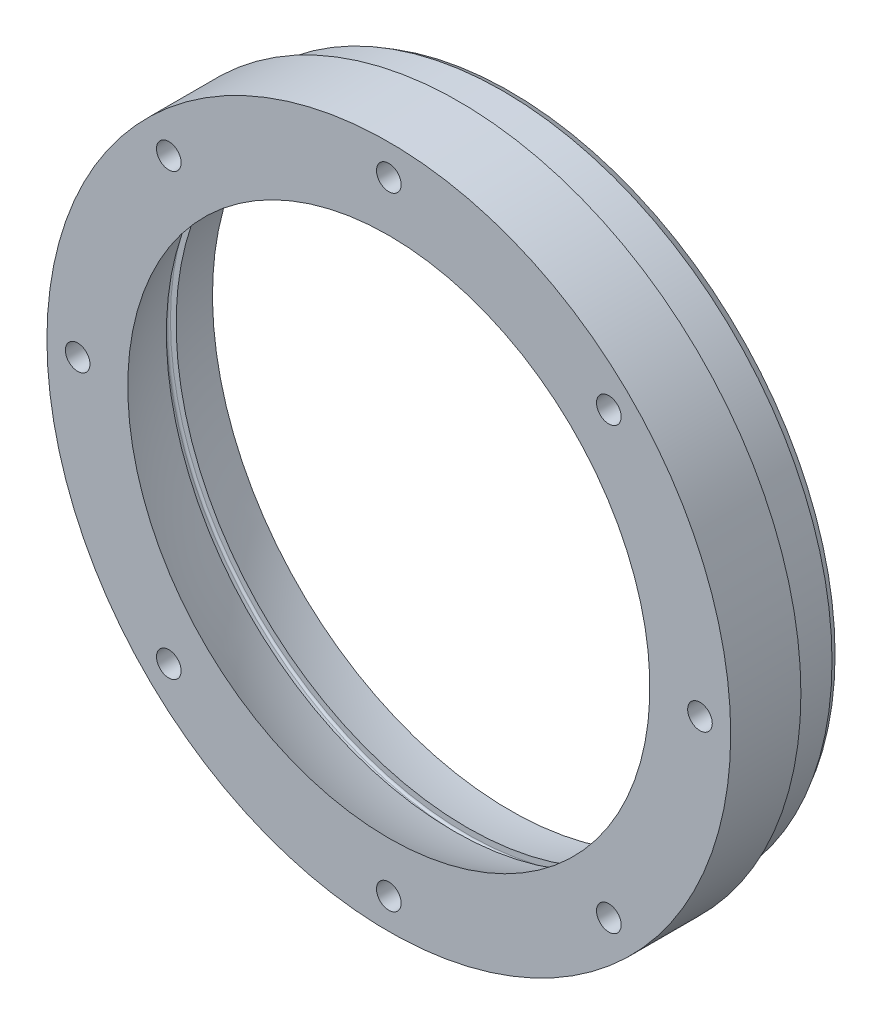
ISO-10303-21;
HEADER;
FILE_DESCRIPTION(('STEP AP214'),'2;1');
FILE_NAME('part.step','',(''),(''),'','','');
FILE_SCHEMA(('AUTOMOTIVE_DESIGN { 1 0 10303 214 1 1 1 1 }'));
ENDSEC;
DATA;
#1=APPLICATION_CONTEXT('core data for automotive mechanical design processes');
#2=APPLICATION_PROTOCOL_DEFINITION('international standard','automotive_design',2000,#1);
#3=PRODUCT_CONTEXT('',#1,'mechanical');
#4=PRODUCT('Part','Part','',(#3));
#5=PRODUCT_RELATED_PRODUCT_CATEGORY('part','',(#4));
#6=PRODUCT_DEFINITION_FORMATION('','',#4);
#7=PRODUCT_DEFINITION_CONTEXT('part definition',#1,'design');
#8=PRODUCT_DEFINITION('design','',#6,#7);
#9=PRODUCT_DEFINITION_SHAPE('','',#8);
#10=(LENGTH_UNIT() NAMED_UNIT(*) SI_UNIT(.MILLI.,.METRE.));
#11=(NAMED_UNIT(*) PLANE_ANGLE_UNIT() SI_UNIT($,.RADIAN.));
#12=(NAMED_UNIT(*) SI_UNIT($,.STERADIAN.) SOLID_ANGLE_UNIT());
#13=UNCERTAINTY_MEASURE_WITH_UNIT(LENGTH_MEASURE(1.E-05),#10,'distance_accuracy_value','');
#14=(GEOMETRIC_REPRESENTATION_CONTEXT(3) GLOBAL_UNCERTAINTY_ASSIGNED_CONTEXT((#13)) GLOBAL_UNIT_ASSIGNED_CONTEXT((#10,
#11,#12)) REPRESENTATION_CONTEXT('',''));
#15=CARTESIAN_POINT('',(0.,0.,0.));
#16=DIRECTION('',(0.,0.,1.));
#17=DIRECTION('',(1.,0.,0.));
#18=AXIS2_PLACEMENT_3D('',#15,#16,#17);
#19=CARTESIAN_POINT('',(0.,0.,-40.));
#20=DIRECTION('',(0.,0.,1.));
#21=DIRECTION('',(0.,1.,0.));
#22=AXIS2_PLACEMENT_3D('',#19,#20,#21);
#23=SPHERICAL_SURFACE('',#22,82.5);
#24=CARTESIAN_POINT('',(0.,0.,0.));
#25=DIRECTION('',(0.,0.,1.));
#26=DIRECTION('',(1.,0.,0.));
#27=AXIS2_PLACEMENT_3D('',#24,#25,#26);
#28=CIRCLE('',#27,72.1543484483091);
#29=CARTESIAN_POINT('',(0.,72.1543484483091,0.));
#30=VERTEX_POINT('',#29);
#31=EDGE_CURVE('E145',#30,#30,#28,.T.);
#32=CARTESIAN_POINT('',(0.,0.,-18.04));
#33=DIRECTION('',(0.,0.,-1.));
#34=DIRECTION('',(-1.,0.,0.));
#35=AXIS2_PLACEMENT_3D('',#32,#33,#34);
#36=CIRCLE('',#35,79.5236342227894);
#37=CARTESIAN_POINT('',(0.,79.5236342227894,-18.04));
#38=VERTEX_POINT('',#37);
#39=EDGE_CURVE('E86',#38,#38,#36,.F.);
#40=CARTESIAN_POINT('',(0.,72.1543484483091,0.));
#41=CARTESIAN_POINT('',(0.,72.2529985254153,-0.177950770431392));
#42=CARTESIAN_POINT('',(0.,72.3509902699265,-0.356266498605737));
#43=CARTESIAN_POINT('',(0.,72.5456517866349,-0.713618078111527));
#44=CARTESIAN_POINT('',(0.,72.6423215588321,-0.892653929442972));
#45=CARTESIAN_POINT('',(0.,72.8343338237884,-1.25143596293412));
#46=CARTESIAN_POINT('',(0.,72.9296763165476,-1.43118214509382));
#47=CARTESIAN_POINT('',(0.,73.1190288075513,-1.79137499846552));
#48=CARTESIAN_POINT('',(0.,73.2130388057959,-1.97182166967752));
#49=CARTESIAN_POINT('',(0.,73.3997211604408,-2.33340562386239));
#50=CARTESIAN_POINT('',(0.,73.4923935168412,-2.51454290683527));
#51=CARTESIAN_POINT('',(0.,73.6763955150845,-2.87749816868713));
#52=CARTESIAN_POINT('',(0.,73.7677251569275,-3.05931614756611));
#53=CARTESIAN_POINT('',(0.,73.9490367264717,-3.42362284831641));
#54=CARTESIAN_POINT('',(0.,74.039018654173,-3.60611157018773));
#55=CARTESIAN_POINT('',(0.,74.2176298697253,-3.97174976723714));
#56=CARTESIAN_POINT('',(0.,74.3062591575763,-4.15489924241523));
#57=CARTESIAN_POINT('',(0.,74.4821602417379,-4.52184892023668));
#58=CARTESIAN_POINT('',(0.,74.5694320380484,-4.70564912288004));
#59=CARTESIAN_POINT('',(0.,74.742613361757,-5.07389019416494));
#60=CARTESIAN_POINT('',(0.,74.8285228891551,-5.25833106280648));
#61=CARTESIAN_POINT('',(0.,74.998974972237,-5.62784336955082));
#62=CARTESIAN_POINT('',(0.,75.083517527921,-5.81291480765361));
#63=CARTESIAN_POINT('',(0.,75.2512310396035,-6.183678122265));
#64=CARTESIAN_POINT('',(0.,75.3344019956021,-6.3693699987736));
#65=CARTESIAN_POINT('',(0.,75.4993677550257,-6.74136402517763));
#66=CARTESIAN_POINT('',(0.,75.5811625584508,-6.92766617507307));
#67=CARTESIAN_POINT('',(0.,75.7433715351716,-7.30087054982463));
#68=CARTESIAN_POINT('',(0.,75.8237857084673,-7.48777277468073));
#69=CARTESIAN_POINT('',(0.,75.9832290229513,-7.86216706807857));
#70=CARTESIAN_POINT('',(0.,76.0622581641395,-8.04965913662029));
#71=CARTESIAN_POINT('',(0.,76.2189270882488,-8.42522285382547));
#72=CARTESIAN_POINT('',(0.,76.2965668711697,-8.61329450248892));
#73=CARTESIAN_POINT('',(0.,76.45045282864,-8.99000708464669));
#74=CARTESIAN_POINT('',(0.,76.5266990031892,-9.17864801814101));
#75=CARTESIAN_POINT('',(0.,76.6777935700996,-9.55648884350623));
#76=CARTESIAN_POINT('',(0.,76.7526419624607,-9.74568873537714));
#77=CARTESIAN_POINT('',(0.,76.9009368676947,-10.1246371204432));
#78=CARTESIAN_POINT('',(0.,76.9743833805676,-10.3143856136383));
#79=CARTESIAN_POINT('',(0.,77.1198705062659,-10.6944208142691));
#80=CARTESIAN_POINT('',(0.,77.1919111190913,-10.8847075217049));
#81=CARTESIAN_POINT('',(0.,77.3345825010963,-11.2658087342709));
#82=CARTESIAN_POINT('',(0.,77.4052132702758,-11.4566232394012));
#83=CARTESIAN_POINT('',(0.,77.5450610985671,-11.8387696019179));
#84=CARTESIAN_POINT('',(0.,77.6142781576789,-12.0301014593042));
#85=CARTESIAN_POINT('',(0.,77.7512947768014,-12.413272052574));
#86=CARTESIAN_POINT('',(0.,77.8190943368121,-12.6051107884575));
#87=CARTESIAN_POINT('',(0.,77.9532722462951,-12.9892846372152));
#88=CARTESIAN_POINT('',(0.,78.0196505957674,-13.1816197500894));
#89=CARTESIAN_POINT('',(0.,78.1509824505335,-13.5667758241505));
#90=CARTESIAN_POINT('',(0.,78.2159359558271,-13.7595967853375));
#91=CARTESIAN_POINT('',(0.,78.3444145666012,-14.1457140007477));
#92=CARTESIAN_POINT('',(0.,78.4079396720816,-14.3390102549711));
#93=CARTESIAN_POINT('',(0.,78.5335580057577,-14.726067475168));
#94=CARTESIAN_POINT('',(0.,78.5956512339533,-14.9198284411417));
#95=CARTESIAN_POINT('',(0.,78.7184024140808,-15.3078044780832));
#96=CARTESIAN_POINT('',(0.,78.7790603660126,-15.502019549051));
#97=CARTESIAN_POINT('',(0.,78.8989376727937,-15.8908931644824));
#98=CARTESIAN_POINT('',(0.,78.9581570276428,-16.0855517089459));
#99=CARTESIAN_POINT('',(0.,79.0751538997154,-16.4753016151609));
#100=CARTESIAN_POINT('',(0.,79.1329314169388,-16.6703929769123));
#101=CARTESIAN_POINT('',(0.,79.2470414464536,-17.060997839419));
#102=CARTESIAN_POINT('',(0.,79.3033739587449,-17.2565113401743));
#103=CARTESIAN_POINT('',(0.,79.4145909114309,-17.6479497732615));
#104=CARTESIAN_POINT('',(0.,79.4694753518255,-17.8438747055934));
#105=CARTESIAN_POINT('',(0.,79.5236342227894,-18.04));
#106=B_SPLINE_CURVE_WITH_KNOTS('',3,(#40,#41,#42,#43,#44,#45,#46,#47,#48,#49,#50,#51,#52,#53,
#54,#55,#56,#57,#58,#59,#60,#61,#62,#63,#64,#65,#66,#67,#68,#69,#70,#71,#72,#73,#74,#75,#76,#77,
#78,#79,#80,#81,#82,#83,#84,#85,#86,#87,#88,#89,#90,#91,#92,#93,#94,#95,#96,#97,#98,#99,#100,
#101,#102,#103,#104,#105),.UNSPECIFIED.,.F.,.F.,(4,2,2,2,2,2,2,2,2,2,2,2,2,2,2,2,2,2,2,2,2,2,2,
2,2,2,2,2,2,2,2,2,4),(0.,0.610395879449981,1.22079175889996,1.83118763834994,2.44158351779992,
3.05197939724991,3.66237527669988,4.27277115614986,4.88316703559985,5.49356291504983,
6.1039587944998,6.71435467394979,7.32475055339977,7.93514643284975,8.54554231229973,
9.15593819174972,9.7663340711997,10.3767299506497,10.9871258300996,11.5975217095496,
12.2079175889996,12.8183134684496,13.4287093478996,14.0391052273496,14.6495011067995,
15.2598969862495,15.8702928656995,16.4806887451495,17.0910846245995,17.7014805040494,
18.3118763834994,18.9222722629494,19.5326681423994),.UNSPECIFIED.);
#107=EDGE_CURVE('BSEAM36',#30,#38,#106,.T.);
#108=ORIENTED_EDGE('',*,*,#31,.T.);
#109=ORIENTED_EDGE('',*,*,#39,.F.);
#110=ORIENTED_EDGE('',*,*,#107,.T.);
#111=ORIENTED_EDGE('',*,*,#107,.F.);
#112=EDGE_LOOP('',(#108,#110,#109,#111));
#113=FACE_BOUND('',#112,.T.);
#114=ADVANCED_FACE('F36',(#113),#23,.F.);
#115=CARTESIAN_POINT('',(0.,94.5,0.));
#116=DIRECTION('',(0.,0.,-1.));
#117=DIRECTION('',(-1.,0.,0.));
#118=AXIS2_PLACEMENT_3D('',#115,#116,#117);
#119=PLANE('',#118);
#120=CARTESIAN_POINT('',(60.8111831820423,60.8111831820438,0.));
#121=DIRECTION('',(0.,0.,1.));
#122=DIRECTION('',(1.,0.,0.));
#123=AXIS2_PLACEMENT_3D('',#120,#121,#122);
#124=CIRCLE('',#123,3.39999999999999);
#125=CARTESIAN_POINT('',(64.2111831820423,60.8111831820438,0.));
#126=VERTEX_POINT('',#125);
#127=EDGE_CURVE('E80',#126,#126,#124,.T.);
#128=ORIENTED_EDGE('',*,*,#127,.F.);
#129=EDGE_LOOP('',(#128));
#130=FACE_BOUND('',#129,.T.);
#131=CARTESIAN_POINT('',(86.,9.00802707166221E-13,0.));
#132=DIRECTION('',(0.,0.,1.));
#133=DIRECTION('',(1.,0.,0.));
#134=AXIS2_PLACEMENT_3D('',#131,#132,#133);
#135=CIRCLE('',#134,3.39999999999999);
#136=CARTESIAN_POINT('',(89.4,9.00802707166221E-13,0.));
#137=VERTEX_POINT('',#136);
#138=EDGE_CURVE('E79',#137,#137,#135,.T.);
#139=ORIENTED_EDGE('',*,*,#138,.F.);
#140=EDGE_LOOP('',(#139));
#141=FACE_BOUND('',#140,.T.);
#142=CARTESIAN_POINT('',(60.8111831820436,-60.8111831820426,0.));
#143=DIRECTION('',(0.,0.,1.));
#144=DIRECTION('',(1.,0.,0.));
#145=AXIS2_PLACEMENT_3D('',#142,#143,#144);
#146=CIRCLE('',#145,3.39999999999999);
#147=CARTESIAN_POINT('',(64.2111831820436,-60.8111831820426,0.));
#148=VERTEX_POINT('',#147);
#149=EDGE_CURVE('E91',#148,#148,#146,.T.);
#150=ORIENTED_EDGE('',*,*,#149,.F.);
#151=EDGE_LOOP('',(#150));
#152=FACE_BOUND('',#151,.T.);
#153=CARTESIAN_POINT('',(6.00535138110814E-13,-86.,0.));
#154=DIRECTION('',(0.,0.,1.));
#155=DIRECTION('',(1.,0.,0.));
#156=AXIS2_PLACEMENT_3D('',#153,#154,#155);
#157=CIRCLE('',#156,3.39999999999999);
#158=CARTESIAN_POINT('',(3.40000000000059,-86.,0.));
#159=VERTEX_POINT('',#158);
#160=EDGE_CURVE('E97',#159,#159,#157,.T.);
#161=ORIENTED_EDGE('',*,*,#160,.F.);
#162=EDGE_LOOP('',(#161));
#163=FACE_BOUND('',#162,.T.);
#164=CARTESIAN_POINT('',(-60.8111831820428,-60.8111831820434,0.));
#165=DIRECTION('',(0.,0.,1.));
#166=DIRECTION('',(1.,0.,0.));
#167=AXIS2_PLACEMENT_3D('',#164,#165,#166);
#168=CIRCLE('',#167,3.39999999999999);
#169=CARTESIAN_POINT('',(-57.4111831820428,-60.8111831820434,0.));
#170=VERTEX_POINT('',#169);
#171=EDGE_CURVE('E103',#170,#170,#168,.T.);
#172=ORIENTED_EDGE('',*,*,#171,.F.);
#173=EDGE_LOOP('',(#172));
#174=FACE_BOUND('',#173,.T.);
#175=CARTESIAN_POINT('',(-86.,-3.00267569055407E-13,0.));
#176=DIRECTION('',(0.,0.,1.));
#177=DIRECTION('',(1.,0.,0.));
#178=AXIS2_PLACEMENT_3D('',#175,#176,#177);
#179=CIRCLE('',#178,3.39999999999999);
#180=CARTESIAN_POINT('',(-82.6,-3.00267569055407E-13,0.));
#181=VERTEX_POINT('',#180);
#182=EDGE_CURVE('E109',#181,#181,#179,.T.);
#183=ORIENTED_EDGE('',*,*,#182,.F.);
#184=EDGE_LOOP('',(#183));
#185=FACE_BOUND('',#184,.T.);
#186=CARTESIAN_POINT('',(-60.8111831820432,60.811183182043,0.));
#187=DIRECTION('',(0.,0.,1.));
#188=DIRECTION('',(1.,0.,0.));
#189=AXIS2_PLACEMENT_3D('',#186,#187,#188);
#190=CIRCLE('',#189,3.39999999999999);
#191=CARTESIAN_POINT('',(-57.4111831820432,60.811183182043,0.));
#192=VERTEX_POINT('',#191);
#193=EDGE_CURVE('E115',#192,#192,#190,.T.);
#194=ORIENTED_EDGE('',*,*,#193,.F.);
#195=EDGE_LOOP('',(#194));
#196=FACE_BOUND('',#195,.T.);
#197=CARTESIAN_POINT('',(0.,86.,0.));
#198=DIRECTION('',(0.,0.,1.));
#199=DIRECTION('',(1.,0.,0.));
#200=AXIS2_PLACEMENT_3D('',#197,#198,#199);
#201=CIRCLE('',#200,3.39999999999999);
#202=CARTESIAN_POINT('',(3.39999999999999,86.,0.));
#203=VERTEX_POINT('',#202);
#204=EDGE_CURVE('E121',#203,#203,#201,.T.);
#205=ORIENTED_EDGE('',*,*,#204,.F.);
#206=EDGE_LOOP('',(#205));
#207=FACE_BOUND('',#206,.T.);
#208=ORIENTED_EDGE('',*,*,#31,.F.);
#209=EDGE_LOOP('',(#208));
#210=FACE_BOUND('',#209,.T.);
#211=CARTESIAN_POINT('',(0.,0.,0.));
#212=DIRECTION('',(0.,0.,1.));
#213=DIRECTION('',(1.,0.,0.));
#214=AXIS2_PLACEMENT_3D('',#211,#212,#213);
#215=CIRCLE('',#214,94.5);
#216=CARTESIAN_POINT('',(94.5,0.,0.));
#217=VERTEX_POINT('',#216);
#218=EDGE_CURVE('E127',#217,#217,#215,.T.);
#219=ORIENTED_EDGE('',*,*,#218,.T.);
#220=EDGE_LOOP('',(#219));
#221=FACE_BOUND('',#220,.T.);
#222=ADVANCED_FACE('F186',(#130,#141,#152,#163,#174,#185,#196,#207,#210,#221),#119,.F.);
#223=CARTESIAN_POINT('',(0.,0.,-21.64));
#224=DIRECTION('',(0.,0.,-1.));
#225=DIRECTION('',(-1.,0.,0.));
#226=AXIS2_PLACEMENT_3D('',#223,#224,#225);
#227=CIRCLE('',#226,80.4310910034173);
#228=CARTESIAN_POINT('',(0.,80.4310910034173,-21.64));
#229=VERTEX_POINT('',#228);
#230=EDGE_CURVE('E149',#229,#229,#227,.F.);
#231=CARTESIAN_POINT('',(0.,0.,-33.5));
#232=DIRECTION('',(0.,0.,1.));
#233=DIRECTION('',(1.,0.,0.));
#234=AXIS2_PLACEMENT_3D('',#231,#232,#233);
#235=CIRCLE('',#234,82.2435407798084);
#236=CARTESIAN_POINT('',(0.,82.2435407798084,-33.5));
#237=VERTEX_POINT('',#236);
#238=EDGE_CURVE('E142',#237,#237,#235,.T.);
#239=CARTESIAN_POINT('',(0.,80.4310910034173,-21.64));
#240=CARTESIAN_POINT('',(0.,80.4589284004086,-21.7619494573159));
#241=CARTESIAN_POINT('',(0.,80.4864884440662,-21.8839622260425));
#242=CARTESIAN_POINT('',(0.,80.5410532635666,-22.1281118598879));
#243=CARTESIAN_POINT('',(0.,80.5680580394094,-22.2502487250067));
#244=CARTESIAN_POINT('',(0.,80.6215117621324,-22.4946440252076));
#245=CARTESIAN_POINT('',(0.,80.6479607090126,-22.6169024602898));
#246=CARTESIAN_POINT('',(0.,80.7003022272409,-22.8615383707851));
#247=CARTESIAN_POINT('',(0.,80.7261947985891,-22.9839158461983));
#248=CARTESIAN_POINT('',(0.,80.7774230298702,-23.228787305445));
#249=CARTESIAN_POINT('',(0.,80.8027586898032,-23.3512812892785));
#250=CARTESIAN_POINT('',(0.,80.8528725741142,-23.5963832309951));
#251=CARTESIAN_POINT('',(0.,80.8776507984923,-23.7189911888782));
#252=CARTESIAN_POINT('',(0.,80.9266492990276,-23.9643185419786));
#253=CARTESIAN_POINT('',(0.,80.9508695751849,-24.0870379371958));
#254=CARTESIAN_POINT('',(0.,80.9987516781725,-24.3325856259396));
#255=CARTESIAN_POINT('',(0.,81.0224135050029,-24.4554139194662));
#256=CARTESIAN_POINT('',(0.,81.0691782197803,-24.7011768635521));
#257=CARTESIAN_POINT('',(0.,81.0922811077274,-24.8241115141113));
#258=CARTESIAN_POINT('',(0.,81.1379274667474,-25.0700846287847));
#259=CARTESIAN_POINT('',(0.,81.1604709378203,-25.193123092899));
#260=CARTESIAN_POINT('',(0.,81.2049979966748,-25.4393012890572));
#261=CARTESIAN_POINT('',(0.,81.2269815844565,-25.5624410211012));
#262=CARTESIAN_POINT('',(0.,81.2703884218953,-25.8088192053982));
#263=CARTESIAN_POINT('',(0.,81.2918116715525,-25.9320576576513));
#264=CARTESIAN_POINT('',(0.,81.3340973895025,-26.1786307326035));
#265=CARTESIAN_POINT('',(0.,81.3549598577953,-26.3019653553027));
#266=CARTESIAN_POINT('',(0.,81.3961235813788,-26.5487282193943));
#267=CARTESIAN_POINT('',(0.,81.4164248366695,-26.6721564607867));
#268=CARTESIAN_POINT('',(0.,81.4564657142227,-26.9191040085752));
#269=CARTESIAN_POINT('',(0.,81.4762053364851,-27.0426233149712));
#270=CARTESIAN_POINT('',(0.,81.5151225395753,-27.2897504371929));
#271=CARTESIAN_POINT('',(0.,81.534300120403,-27.4133582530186));
#272=CARTESIAN_POINT('',(0.,81.5720928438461,-27.6606598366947));
#273=CARTESIAN_POINT('',(0.,81.5907079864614,-27.7843536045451));
#274=CARTESIAN_POINT('',(0.,81.6273754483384,-28.0318245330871));
#275=CARTESIAN_POINT('',(0.,81.6454277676,-28.1556016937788));
#276=CARTESIAN_POINT('',(0.,81.6809692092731,-28.4032368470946));
#277=CARTESIAN_POINT('',(0.,81.6984583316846,-28.5270948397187));
#278=CARTESIAN_POINT('',(0.,81.7328730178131,-28.7748890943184));
#279=CARTESIAN_POINT('',(0.,81.7497985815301,-28.898825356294));
#280=CARTESIAN_POINT('',(0.,81.7830858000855,-29.1467735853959));
#281=CARTESIAN_POINT('',(0.,81.7994474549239,-29.2707855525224));
#282=CARTESIAN_POINT('',(0.,81.8316065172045,-29.5188826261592));
#283=CARTESIAN_POINT('',(0.,81.8474039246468,-29.6429677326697));
#284=CARTESIAN_POINT('',(0.,81.8784341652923,-29.8912085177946));
#285=CARTESIAN_POINT('',(0.,81.8936669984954,-30.0153641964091));
#286=CARTESIAN_POINT('',(0.,81.9235677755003,-30.2637435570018));
#287=CARTESIAN_POINT('',(0.,81.938235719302,-30.3879672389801));
#288=CARTESIAN_POINT('',(0.,81.9670064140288,-30.6364800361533));
#289=CARTESIAN_POINT('',(0.,81.9811091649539,-30.7607691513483));
#290=CARTESIAN_POINT('',(0.,82.0087491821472,-31.009410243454));
#291=CARTESIAN_POINT('',(0.,82.0222864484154,-31.1337622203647));
#292=CARTESIAN_POINT('',(0.,82.0487952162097,-31.3825264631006));
#293=CARTESIAN_POINT('',(0.,82.0617667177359,-31.5069387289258));
#294=CARTESIAN_POINT('',(0.,82.087143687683,-31.7558209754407));
#295=CARTESIAN_POINT('',(0.,82.0995491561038,-31.8802909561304));
#296=CARTESIAN_POINT('',(0.,82.1237938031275,-32.1292860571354));
#297=CARTESIAN_POINT('',(0.,82.1356329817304,-32.2538111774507));
#298=CARTESIAN_POINT('',(0.,82.1587448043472,-32.5029139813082));
#299=CARTESIAN_POINT('',(0.,82.1700174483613,-32.6274916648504));
#300=CARTESIAN_POINT('',(0.,82.1919959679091,-32.8766970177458));
#301=CARTESIAN_POINT('',(0.,82.2027018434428,-33.0013246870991));
#302=CARTESIAN_POINT('',(0.,82.2235466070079,-33.250627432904));
#303=CARTESIAN_POINT('',(0.,82.2336854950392,-33.3753025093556));
#304=CARTESIAN_POINT('',(0.,82.2435407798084,-33.5));
#305=B_SPLINE_CURVE_WITH_KNOTS('',3,(#239,#240,#241,#242,#243,#244,#245,#246,#247,#248,#249,
#250,#251,#252,#253,#254,#255,#256,#257,#258,#259,#260,#261,#262,#263,#264,#265,#266,#267,#268,
#269,#270,#271,#272,#273,#274,#275,#276,#277,#278,#279,#280,#281,#282,#283,#284,#285,#286,#287,
#288,#289,#290,#291,#292,#293,#294,#295,#296,#297,#298,#299,#300,#301,#302,#303,#304),
.UNSPECIFIED.,.F.,.F.,(4,2,2,2,2,2,2,2,2,2,2,2,2,2,2,2,2,2,2,2,2,2,2,2,2,2,2,2,2,2,2,2,4),(0.,
0.375258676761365,0.750517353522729,1.1257760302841,1.50103470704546,1.87629338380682,
2.25155206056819,2.62681073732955,3.00206941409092,3.37732809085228,3.75258676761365,
4.12784544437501,4.50310412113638,4.87836279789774,5.25362147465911,5.62888015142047,
6.00413882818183,6.3793975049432,6.75465618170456,7.12991485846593,7.5051735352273,
7.88043221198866,8.25569088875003,8.63094956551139,9.00620824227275,9.38146691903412,
9.75672559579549,10.1319842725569,10.5072429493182,10.8825016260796,11.2577603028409,
11.6330189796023,12.0082776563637),.UNSPECIFIED.);
#306=EDGE_CURVE('BSEAM189',#229,#237,#305,.T.);
#307=ORIENTED_EDGE('',*,*,#230,.T.);
#308=ORIENTED_EDGE('',*,*,#238,.F.);
#309=ORIENTED_EDGE('',*,*,#306,.T.);
#310=ORIENTED_EDGE('',*,*,#306,.F.);
#311=EDGE_LOOP('',(#307,#309,#308,#310));
#312=FACE_BOUND('',#311,.T.);
#313=ADVANCED_FACE('F189',(#312),#23,.F.);
#314=CARTESIAN_POINT('',(0.,89.8452994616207,-33.5));
#315=DIRECTION('',(0.,0.,1.));
#316=DIRECTION('',(1.,0.,0.));
#317=AXIS2_PLACEMENT_3D('',#314,#315,#316);
#318=PLANE('',#317);
#319=CARTESIAN_POINT('',(0.,0.,-33.5));
#320=DIRECTION('',(0.,0.,1.));
#321=DIRECTION('',(1.,0.,0.));
#322=AXIS2_PLACEMENT_3D('',#319,#320,#321);
#323=CIRCLE('',#322,89.8452994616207);
#324=CARTESIAN_POINT('',(89.8452994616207,0.,-33.5));
#325=VERTEX_POINT('',#324);
#326=EDGE_CURVE('E139',#325,#325,#323,.T.);
#327=ORIENTED_EDGE('',*,*,#326,.F.);
#328=EDGE_LOOP('',(#327));
#329=FACE_BOUND('',#328,.T.);
#330=ORIENTED_EDGE('',*,*,#238,.T.);
#331=EDGE_LOOP('',(#330));
#332=FACE_BOUND('',#331,.T.);
#333=ADVANCED_FACE('F197',(#329,#332),#318,.F.);
#334=CARTESIAN_POINT('',(0.,0.,-33.5));
#335=DIRECTION('',(0.,0.,1.));
#336=DIRECTION('',(1.,0.,0.));
#337=AXIS2_PLACEMENT_3D('',#334,#335,#336);
#338=CONICAL_SURFACE('',#337,89.8452994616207,0.523598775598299);
#339=CARTESIAN_POINT('',(0.,0.,-31.5));
#340=DIRECTION('',(0.,0.,1.));
#341=DIRECTION('',(1.,0.,0.));
#342=AXIS2_PLACEMENT_3D('',#339,#340,#341);
#343=CIRCLE('',#342,91.);
#344=CARTESIAN_POINT('',(91.,0.,-31.5));
#345=VERTEX_POINT('',#344);
#346=EDGE_CURVE('E136',#345,#345,#343,.T.);
#347=ORIENTED_EDGE('',*,*,#346,.F.);
#348=EDGE_LOOP('',(#347));
#349=FACE_BOUND('',#348,.T.);
#350=ORIENTED_EDGE('',*,*,#326,.T.);
#351=EDGE_LOOP('',(#350));
#352=FACE_BOUND('',#351,.T.);
#353=ADVANCED_FACE('F202',(#349,#352),#338,.T.);
#354=CARTESIAN_POINT('',(0.,0.,0.));
#355=DIRECTION('',(0.,0.,1.));
#356=DIRECTION('',(1.,0.,0.));
#357=AXIS2_PLACEMENT_3D('',#354,#355,#356);
#358=CYLINDRICAL_SURFACE('',#357,91.);
#359=CARTESIAN_POINT('',(0.,0.,-19.4));
#360=DIRECTION('',(0.,0.,1.));
#361=DIRECTION('',(1.,0.,0.));
#362=AXIS2_PLACEMENT_3D('',#359,#360,#361);
#363=CIRCLE('',#362,91.);
#364=CARTESIAN_POINT('',(91.,0.,-19.4));
#365=VERTEX_POINT('',#364);
#366=EDGE_CURVE('E133',#365,#365,#363,.T.);
#367=ORIENTED_EDGE('',*,*,#366,.F.);
#368=EDGE_LOOP('',(#367));
#369=FACE_BOUND('',#368,.T.);
#370=ORIENTED_EDGE('',*,*,#346,.T.);
#371=EDGE_LOOP('',(#370));
#372=FACE_BOUND('',#371,.T.);
#373=ADVANCED_FACE('F275',(#369,#372),#358,.T.);
#374=CARTESIAN_POINT('',(0.,94.5,-19.4));
#375=DIRECTION('',(0.,0.,1.));
#376=DIRECTION('',(1.,0.,0.));
#377=AXIS2_PLACEMENT_3D('',#374,#375,#376);
#378=PLANE('',#377);
#379=CARTESIAN_POINT('',(0.,0.,-19.4));
#380=DIRECTION('',(0.,0.,1.));
#381=DIRECTION('',(1.,0.,0.));
#382=AXIS2_PLACEMENT_3D('',#379,#380,#381);
#383=CIRCLE('',#382,94.5);
#384=CARTESIAN_POINT('',(94.5,0.,-19.4));
#385=VERTEX_POINT('',#384);
#386=EDGE_CURVE('E130',#385,#385,#383,.T.);
#387=ORIENTED_EDGE('',*,*,#386,.F.);
#388=EDGE_LOOP('',(#387));
#389=FACE_BOUND('',#388,.T.);
#390=ORIENTED_EDGE('',*,*,#366,.T.);
#391=EDGE_LOOP('',(#390));
#392=FACE_BOUND('',#391,.T.);
#393=ADVANCED_FACE('F271',(#389,#392),#378,.F.);
#394=CARTESIAN_POINT('',(0.,0.,0.));
#395=DIRECTION('',(0.,0.,1.));
#396=DIRECTION('',(1.,0.,0.));
#397=AXIS2_PLACEMENT_3D('',#394,#395,#396);
#398=CYLINDRICAL_SURFACE('',#397,94.5);
#399=ORIENTED_EDGE('',*,*,#218,.F.);
#400=EDGE_LOOP('',(#399));
#401=FACE_BOUND('',#400,.T.);
#402=ORIENTED_EDGE('',*,*,#386,.T.);
#403=EDGE_LOOP('',(#402));
#404=FACE_BOUND('',#403,.T.);
#405=ADVANCED_FACE('F268',(#401,#404),#398,.T.);
#406=CARTESIAN_POINT('',(0.,86.,-10.5));
#407=DIRECTION('',(0.,0.,1.));
#408=DIRECTION('',(1.,0.,0.));
#409=AXIS2_PLACEMENT_3D('',#406,#407,#408);
#410=CONICAL_SURFACE('',#409,3.4,1.02974425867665);
#411=CARTESIAN_POINT('',(0.,86.,-12.5429261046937));
#412=VERTEX_POINT('',#411);
#413=VERTEX_LOOP('',#412);
#414=FACE_BOUND('',#413,.T.);
#415=CARTESIAN_POINT('',(0.,86.,-10.5));
#416=DIRECTION('',(0.,0.,1.));
#417=DIRECTION('',(1.,0.,0.));
#418=AXIS2_PLACEMENT_3D('',#415,#416,#417);
#419=CIRCLE('',#418,3.4);
#420=CARTESIAN_POINT('',(3.4,86.,-10.5));
#421=VERTEX_POINT('',#420);
#422=EDGE_CURVE('E124',#421,#421,#419,.T.);
#423=ORIENTED_EDGE('',*,*,#422,.T.);
#424=EDGE_LOOP('',(#423));
#425=FACE_BOUND('',#424,.T.);
#426=ADVANCED_FACE('F264',(#414,#425),#410,.F.);
#427=CARTESIAN_POINT('',(0.,86.,0.));
#428=DIRECTION('',(0.,0.,1.));
#429=DIRECTION('',(1.,0.,0.));
#430=AXIS2_PLACEMENT_3D('',#427,#428,#429);
#431=CYLINDRICAL_SURFACE('',#430,3.39999999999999);
#432=ORIENTED_EDGE('',*,*,#422,.F.);
#433=EDGE_LOOP('',(#432));
#434=FACE_BOUND('',#433,.T.);
#435=ORIENTED_EDGE('',*,*,#204,.T.);
#436=EDGE_LOOP('',(#435));
#437=FACE_BOUND('',#436,.T.);
#438=ADVANCED_FACE('F261',(#434,#437),#431,.F.);
#439=CARTESIAN_POINT('',(-60.8111831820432,60.811183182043,-10.5));
#440=DIRECTION('',(0.,0.,1.));
#441=DIRECTION('',(1.,0.,0.));
#442=AXIS2_PLACEMENT_3D('',#439,#440,#441);
#443=CONICAL_SURFACE('',#442,3.4,1.02974425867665);
#444=CARTESIAN_POINT('',(-60.8111831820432,60.811183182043,-12.5429261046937));
#445=VERTEX_POINT('',#444);
#446=VERTEX_LOOP('',#445);
#447=FACE_BOUND('',#446,.T.);
#448=CARTESIAN_POINT('',(-60.8111831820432,60.811183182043,-10.5));
#449=DIRECTION('',(0.,0.,1.));
#450=DIRECTION('',(1.,0.,0.));
#451=AXIS2_PLACEMENT_3D('',#448,#449,#450);
#452=CIRCLE('',#451,3.4);
#453=CARTESIAN_POINT('',(-57.4111831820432,60.811183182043,-10.5));
#454=VERTEX_POINT('',#453);
#455=EDGE_CURVE('E118',#454,#454,#452,.T.);
#456=ORIENTED_EDGE('',*,*,#455,.T.);
#457=EDGE_LOOP('',(#456));
#458=FACE_BOUND('',#457,.T.);
#459=ADVANCED_FACE('F257',(#447,#458),#443,.F.);
#460=CARTESIAN_POINT('',(-60.8111831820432,60.811183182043,0.));
#461=DIRECTION('',(0.,0.,1.));
#462=DIRECTION('',(1.,0.,0.));
#463=AXIS2_PLACEMENT_3D('',#460,#461,#462);
#464=CYLINDRICAL_SURFACE('',#463,3.39999999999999);
#465=ORIENTED_EDGE('',*,*,#455,.F.);
#466=EDGE_LOOP('',(#465));
#467=FACE_BOUND('',#466,.T.);
#468=ORIENTED_EDGE('',*,*,#193,.T.);
#469=EDGE_LOOP('',(#468));
#470=FACE_BOUND('',#469,.T.);
#471=ADVANCED_FACE('F253',(#467,#470),#464,.F.);
#472=CARTESIAN_POINT('',(-86.,-3.00267569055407E-13,-10.5));
#473=DIRECTION('',(0.,0.,1.));
#474=DIRECTION('',(1.,0.,0.));
#475=AXIS2_PLACEMENT_3D('',#472,#473,#474);
#476=CONICAL_SURFACE('',#475,3.4,1.02974425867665);
#477=CARTESIAN_POINT('',(-86.,-3.00267569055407E-13,-12.5429261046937));
#478=VERTEX_POINT('',#477);
#479=VERTEX_LOOP('',#478);
#480=FACE_BOUND('',#479,.T.);
#481=CARTESIAN_POINT('',(-86.,-3.00267569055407E-13,-10.5));
#482=DIRECTION('',(0.,0.,1.));
#483=DIRECTION('',(1.,0.,0.));
#484=AXIS2_PLACEMENT_3D('',#481,#482,#483);
#485=CIRCLE('',#484,3.4);
#486=CARTESIAN_POINT('',(-82.6,-3.00267569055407E-13,-10.5));
#487=VERTEX_POINT('',#486);
#488=EDGE_CURVE('E112',#487,#487,#485,.T.);
#489=ORIENTED_EDGE('',*,*,#488,.T.);
#490=EDGE_LOOP('',(#489));
#491=FACE_BOUND('',#490,.T.);
#492=ADVANCED_FACE('F249',(#480,#491),#476,.F.);
#493=CARTESIAN_POINT('',(-86.,-3.00267569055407E-13,0.));
#494=DIRECTION('',(0.,0.,1.));
#495=DIRECTION('',(1.,0.,0.));
#496=AXIS2_PLACEMENT_3D('',#493,#494,#495);
#497=CYLINDRICAL_SURFACE('',#496,3.39999999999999);
#498=ORIENTED_EDGE('',*,*,#488,.F.);
#499=EDGE_LOOP('',(#498));
#500=FACE_BOUND('',#499,.T.);
#501=ORIENTED_EDGE('',*,*,#182,.T.);
#502=EDGE_LOOP('',(#501));
#503=FACE_BOUND('',#502,.T.);
#504=ADVANCED_FACE('F245',(#500,#503),#497,.F.);
#505=CARTESIAN_POINT('',(-60.8111831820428,-60.8111831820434,-10.5));
#506=DIRECTION('',(0.,0.,1.));
#507=DIRECTION('',(1.,0.,0.));
#508=AXIS2_PLACEMENT_3D('',#505,#506,#507);
#509=CONICAL_SURFACE('',#508,3.4,1.02974425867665);
#510=CARTESIAN_POINT('',(-60.8111831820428,-60.8111831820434,-12.5429261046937));
#511=VERTEX_POINT('',#510);
#512=VERTEX_LOOP('',#511);
#513=FACE_BOUND('',#512,.T.);
#514=CARTESIAN_POINT('',(-60.8111831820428,-60.8111831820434,-10.5));
#515=DIRECTION('',(0.,0.,1.));
#516=DIRECTION('',(1.,0.,0.));
#517=AXIS2_PLACEMENT_3D('',#514,#515,#516);
#518=CIRCLE('',#517,3.4);
#519=CARTESIAN_POINT('',(-57.4111831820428,-60.8111831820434,-10.5));
#520=VERTEX_POINT('',#519);
#521=EDGE_CURVE('E106',#520,#520,#518,.T.);
#522=ORIENTED_EDGE('',*,*,#521,.T.);
#523=EDGE_LOOP('',(#522));
#524=FACE_BOUND('',#523,.T.);
#525=ADVANCED_FACE('F241',(#513,#524),#509,.F.);
#526=CARTESIAN_POINT('',(-60.8111831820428,-60.8111831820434,0.));
#527=DIRECTION('',(0.,0.,1.));
#528=DIRECTION('',(1.,0.,0.));
#529=AXIS2_PLACEMENT_3D('',#526,#527,#528);
#530=CYLINDRICAL_SURFACE('',#529,3.39999999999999);
#531=ORIENTED_EDGE('',*,*,#521,.F.);
#532=EDGE_LOOP('',(#531));
#533=FACE_BOUND('',#532,.T.);
#534=ORIENTED_EDGE('',*,*,#171,.T.);
#535=EDGE_LOOP('',(#534));
#536=FACE_BOUND('',#535,.T.);
#537=ADVANCED_FACE('F237',(#533,#536),#530,.F.);
#538=CARTESIAN_POINT('',(6.00535138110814E-13,-86.,-10.5));
#539=DIRECTION('',(0.,0.,1.));
#540=DIRECTION('',(1.,0.,0.));
#541=AXIS2_PLACEMENT_3D('',#538,#539,#540);
#542=CONICAL_SURFACE('',#541,3.4,1.02974425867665);
#543=CARTESIAN_POINT('',(5.97463007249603E-13,-86.,-12.5429261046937));
#544=VERTEX_POINT('',#543);
#545=VERTEX_LOOP('',#544);
#546=FACE_BOUND('',#545,.T.);
#547=CARTESIAN_POINT('',(6.00535138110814E-13,-86.,-10.5));
#548=DIRECTION('',(0.,0.,1.));
#549=DIRECTION('',(1.,0.,0.));
#550=AXIS2_PLACEMENT_3D('',#547,#548,#549);
#551=CIRCLE('',#550,3.4);
#552=CARTESIAN_POINT('',(3.4000000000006,-86.,-10.5));
#553=VERTEX_POINT('',#552);
#554=EDGE_CURVE('E100',#553,#553,#551,.T.);
#555=ORIENTED_EDGE('',*,*,#554,.T.);
#556=EDGE_LOOP('',(#555));
#557=FACE_BOUND('',#556,.T.);
#558=ADVANCED_FACE('F233',(#546,#557),#542,.F.);
#559=CARTESIAN_POINT('',(6.00535138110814E-13,-86.,0.));
#560=DIRECTION('',(0.,0.,1.));
#561=DIRECTION('',(1.,0.,0.));
#562=AXIS2_PLACEMENT_3D('',#559,#560,#561);
#563=CYLINDRICAL_SURFACE('',#562,3.39999999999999);
#564=ORIENTED_EDGE('',*,*,#554,.F.);
#565=EDGE_LOOP('',(#564));
#566=FACE_BOUND('',#565,.T.);
#567=ORIENTED_EDGE('',*,*,#160,.T.);
#568=EDGE_LOOP('',(#567));
#569=FACE_BOUND('',#568,.T.);
#570=ADVANCED_FACE('F229',(#566,#569),#563,.F.);
#571=CARTESIAN_POINT('',(60.8111831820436,-60.8111831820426,-10.5));
#572=DIRECTION('',(0.,0.,1.));
#573=DIRECTION('',(1.,0.,0.));
#574=AXIS2_PLACEMENT_3D('',#571,#572,#573);
#575=CONICAL_SURFACE('',#574,3.39999999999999,1.02974425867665);
#576=CARTESIAN_POINT('',(60.8111831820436,-60.8111831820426,-12.5429261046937));
#577=VERTEX_POINT('',#576);
#578=VERTEX_LOOP('',#577);
#579=FACE_BOUND('',#578,.T.);
#580=CARTESIAN_POINT('',(60.8111831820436,-60.8111831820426,-10.5));
#581=DIRECTION('',(0.,0.,1.));
#582=DIRECTION('',(1.,0.,0.));
#583=AXIS2_PLACEMENT_3D('',#580,#581,#582);
#584=CIRCLE('',#583,3.39999999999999);
#585=CARTESIAN_POINT('',(64.2111831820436,-60.8111831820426,-10.5));
#586=VERTEX_POINT('',#585);
#587=EDGE_CURVE('E94',#586,#586,#584,.T.);
#588=ORIENTED_EDGE('',*,*,#587,.T.);
#589=EDGE_LOOP('',(#588));
#590=FACE_BOUND('',#589,.T.);
#591=ADVANCED_FACE('F225',(#579,#590),#575,.F.);
#592=CARTESIAN_POINT('',(60.8111831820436,-60.8111831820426,0.));
#593=DIRECTION('',(0.,0.,1.));
#594=DIRECTION('',(1.,0.,0.));
#595=AXIS2_PLACEMENT_3D('',#592,#593,#594);
#596=CYLINDRICAL_SURFACE('',#595,3.39999999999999);
#597=ORIENTED_EDGE('',*,*,#587,.F.);
#598=EDGE_LOOP('',(#597));
#599=FACE_BOUND('',#598,.T.);
#600=ORIENTED_EDGE('',*,*,#149,.T.);
#601=EDGE_LOOP('',(#600));
#602=FACE_BOUND('',#601,.T.);
#603=ADVANCED_FACE('F221',(#599,#602),#596,.F.);
#604=CARTESIAN_POINT('',(86.,9.00802707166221E-13,-10.5));
#605=DIRECTION('',(0.,0.,1.));
#606=DIRECTION('',(1.,0.,0.));
#607=AXIS2_PLACEMENT_3D('',#604,#605,#606);
#608=CONICAL_SURFACE('',#607,3.4,1.02974425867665);
#609=CARTESIAN_POINT('',(86.,9.00802707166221E-13,-12.5429261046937));
#610=VERTEX_POINT('',#609);
#611=VERTEX_LOOP('',#610);
#612=FACE_BOUND('',#611,.T.);
#613=CARTESIAN_POINT('',(86.,9.00802707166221E-13,-10.5));
#614=DIRECTION('',(0.,0.,1.));
#615=DIRECTION('',(1.,0.,0.));
#616=AXIS2_PLACEMENT_3D('',#613,#614,#615);
#617=CIRCLE('',#616,3.4);
#618=CARTESIAN_POINT('',(89.4,9.00802707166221E-13,-10.5));
#619=VERTEX_POINT('',#618);
#620=EDGE_CURVE('E83',#619,#619,#617,.T.);
#621=ORIENTED_EDGE('',*,*,#620,.T.);
#622=EDGE_LOOP('',(#621));
#623=FACE_BOUND('',#622,.T.);
#624=ADVANCED_FACE('F217',(#612,#623),#608,.F.);
#625=CARTESIAN_POINT('',(86.,9.00802707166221E-13,0.));
#626=DIRECTION('',(0.,0.,1.));
#627=DIRECTION('',(1.,0.,0.));
#628=AXIS2_PLACEMENT_3D('',#625,#626,#627);
#629=CYLINDRICAL_SURFACE('',#628,3.39999999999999);
#630=ORIENTED_EDGE('',*,*,#620,.F.);
#631=EDGE_LOOP('',(#630));
#632=FACE_BOUND('',#631,.T.);
#633=ORIENTED_EDGE('',*,*,#138,.T.);
#634=EDGE_LOOP('',(#633));
#635=FACE_BOUND('',#634,.T.);
#636=ADVANCED_FACE('F73',(#632,#635),#629,.F.);
#637=CARTESIAN_POINT('',(60.8111831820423,60.8111831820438,-10.5));
#638=DIRECTION('',(0.,0.,1.));
#639=DIRECTION('',(1.,0.,0.));
#640=AXIS2_PLACEMENT_3D('',#637,#638,#639);
#641=CONICAL_SURFACE('',#640,3.4,1.02974425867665);
#642=CARTESIAN_POINT('',(60.8111831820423,60.8111831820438,-12.5429261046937));
#643=VERTEX_POINT('',#642);
#644=VERTEX_LOOP('',#643);
#645=FACE_BOUND('',#644,.T.);
#646=CARTESIAN_POINT('',(60.8111831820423,60.8111831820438,-10.5));
#647=DIRECTION('',(0.,0.,1.));
#648=DIRECTION('',(1.,0.,0.));
#649=AXIS2_PLACEMENT_3D('',#646,#647,#648);
#650=CIRCLE('',#649,3.4);
#651=CARTESIAN_POINT('',(64.2111831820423,60.8111831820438,-10.5));
#652=VERTEX_POINT('',#651);
#653=EDGE_CURVE('E77',#652,#652,#650,.T.);
#654=ORIENTED_EDGE('',*,*,#653,.T.);
#655=EDGE_LOOP('',(#654));
#656=FACE_BOUND('',#655,.T.);
#657=ADVANCED_FACE('F69',(#645,#656),#641,.F.);
#658=CARTESIAN_POINT('',(60.8111831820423,60.8111831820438,0.));
#659=DIRECTION('',(0.,0.,1.));
#660=DIRECTION('',(1.,0.,0.));
#661=AXIS2_PLACEMENT_3D('',#658,#659,#660);
#662=CYLINDRICAL_SURFACE('',#661,3.39999999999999);
#663=ORIENTED_EDGE('',*,*,#653,.F.);
#664=EDGE_LOOP('',(#663));
#665=FACE_BOUND('',#664,.T.);
#666=ORIENTED_EDGE('',*,*,#127,.T.);
#667=EDGE_LOOP('',(#666));
#668=FACE_BOUND('',#667,.T.);
#669=ADVANCED_FACE('F72',(#665,#668),#662,.F.);
#670=CARTESIAN_POINT('',(0.,0.,-18.04));
#671=DIRECTION('',(0.,0.,-1.));
#672=DIRECTION('',(-1.,0.,0.));
#673=AXIS2_PLACEMENT_3D('',#670,#671,#672);
#674=PLANE('',#673);
#675=CARTESIAN_POINT('',(0.,0.,-18.04));
#676=DIRECTION('',(0.,0.,-1.));
#677=DIRECTION('',(-1.,0.,0.));
#678=AXIS2_PLACEMENT_3D('',#675,#676,#677);
#679=CIRCLE('',#678,82.);
#680=CARTESIAN_POINT('',(-82.,0.,-18.04));
#681=VERTEX_POINT('',#680);
#682=EDGE_CURVE('E11',#681,#681,#679,.T.);
#683=ORIENTED_EDGE('',*,*,#682,.T.);
#684=EDGE_LOOP('',(#683));
#685=FACE_BOUND('',#684,.T.);
#686=ORIENTED_EDGE('',*,*,#39,.T.);
#687=EDGE_LOOP('',(#686));
#688=FACE_BOUND('',#687,.T.);
#689=ADVANCED_FACE('F179',(#685,#688),#674,.T.);
#690=CARTESIAN_POINT('',(0.,0.,-21.64));
#691=DIRECTION('',(0.,0.,-1.));
#692=DIRECTION('',(-1.,0.,0.));
#693=AXIS2_PLACEMENT_3D('',#690,#691,#692);
#694=PLANE('',#693);
#695=CARTESIAN_POINT('',(0.,0.,-21.64));
#696=DIRECTION('',(0.,0.,-1.));
#697=DIRECTION('',(-1.,0.,0.));
#698=AXIS2_PLACEMENT_3D('',#695,#696,#697);
#699=CIRCLE('',#698,82.);
#700=CARTESIAN_POINT('',(-82.,0.,-21.64));
#701=VERTEX_POINT('',#700);
#702=EDGE_CURVE('E44',#701,#701,#699,.F.);
#703=ORIENTED_EDGE('',*,*,#702,.T.);
#704=EDGE_LOOP('',(#703));
#705=FACE_BOUND('',#704,.T.);
#706=ORIENTED_EDGE('',*,*,#230,.F.);
#707=EDGE_LOOP('',(#706));
#708=FACE_BOUND('',#707,.T.);
#709=ADVANCED_FACE('F161',(#705,#708),#694,.F.);
#710=CARTESIAN_POINT('',(0.,0.,-18.04));
#711=DIRECTION('',(0.,0.,-1.));
#712=DIRECTION('',(-1.,0.,0.));
#713=AXIS2_PLACEMENT_3D('',#710,#711,#712);
#714=CYLINDRICAL_SURFACE('',#713,82.6);
#715=CARTESIAN_POINT('',(0.,0.,-21.04));
#716=DIRECTION('',(0.,0.,-1.));
#717=DIRECTION('',(-1.,0.,0.));
#718=AXIS2_PLACEMENT_3D('',#715,#716,#717);
#719=CIRCLE('',#718,82.6);
#720=CARTESIAN_POINT('',(-82.6,0.,-21.04));
#721=VERTEX_POINT('',#720);
#722=EDGE_CURVE('E156',#721,#721,#719,.T.);
#723=ORIENTED_EDGE('',*,*,#722,.T.);
#724=EDGE_LOOP('',(#723));
#725=FACE_BOUND('',#724,.T.);
#726=CARTESIAN_POINT('',(0.,0.,-18.64));
#727=DIRECTION('',(0.,0.,-1.));
#728=DIRECTION('',(-1.,0.,0.));
#729=AXIS2_PLACEMENT_3D('',#726,#727,#728);
#730=CIRCLE('',#729,82.6);
#731=CARTESIAN_POINT('',(-82.6,0.,-18.64));
#732=VERTEX_POINT('',#731);
#733=EDGE_CURVE('E148',#732,#732,#730,.F.);
#734=ORIENTED_EDGE('',*,*,#733,.T.);
#735=EDGE_LOOP('',(#734));
#736=FACE_BOUND('',#735,.T.);
#737=ADVANCED_FACE('F167',(#725,#736),#714,.F.);
#738=CARTESIAN_POINT('',(0.,0.,-21.04));
#739=DIRECTION('',(0.,0.,-1.));
#740=DIRECTION('',(-1.,0.,0.));
#741=AXIS2_PLACEMENT_3D('',#738,#739,#740);
#742=TOROIDAL_SURFACE('',#741,82.,0.6);
#743=ORIENTED_EDGE('',*,*,#702,.F.);
#744=EDGE_LOOP('',(#743));
#745=FACE_BOUND('',#744,.T.);
#746=ORIENTED_EDGE('',*,*,#722,.F.);
#747=EDGE_LOOP('',(#746));
#748=FACE_BOUND('',#747,.T.);
#749=ADVANCED_FACE('F164',(#745,#748),#742,.F.);
#750=CARTESIAN_POINT('',(0.,0.,-18.64));
#751=DIRECTION('',(0.,0.,-1.));
#752=DIRECTION('',(-1.,0.,0.));
#753=AXIS2_PLACEMENT_3D('',#750,#751,#752);
#754=TOROIDAL_SURFACE('',#753,82.,0.6);
#755=ORIENTED_EDGE('',*,*,#733,.F.);
#756=EDGE_LOOP('',(#755));
#757=FACE_BOUND('',#756,.T.);
#758=ORIENTED_EDGE('',*,*,#682,.F.);
#759=EDGE_LOOP('',(#758));
#760=FACE_BOUND('',#759,.T.);
#761=ADVANCED_FACE('F38',(#757,#760),#754,.F.);
#762=CLOSED_SHELL('',(#114,#222,#313,#333,#353,#373,#393,#405,#426,#438,#459,#471,#492,#504,
#525,#537,#558,#570,#591,#603,#624,#636,#657,#669,#689,#709,#737,#749,#761));
#763=MANIFOLD_SOLID_BREP('B2',#762);
#764=ADVANCED_BREP_SHAPE_REPRESENTATION('',(#18,#763),#14);
#765=SHAPE_DEFINITION_REPRESENTATION(#9,#764);
ENDSEC;
END-ISO-10303-21;
